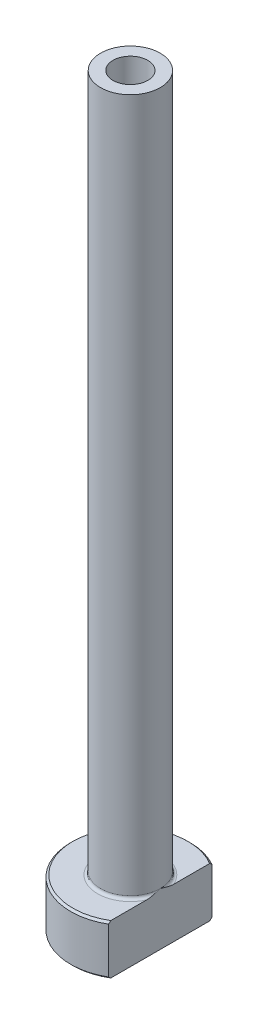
from build123d import *

# Parameters (mm, degrees)
FILLET1_R          = 0.3
CHAMFER1_SIZE      = 0.2
CUT_EXTRUDE1_DEPTH = 76.478473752
CHAMFER2_SIZE      = 0.5


with BuildPart() as part:
    # Sketch1 → Revolve1 (revolve)
    with BuildSketch(Plane.XY, mode=Mode.PRIVATE) as revolve1_sk:
        Polygon((-1.75, 75), (-3, 75), (-3, 5), (-6, 5), (-6, 0), (-2, 0), (-2, 18), (-1.75, 30), align=None)
    revolve(revolve1_sk.sketch.rotate(Axis((0, 92.187680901, 0), (0, -1, 0)), 270), axis=Axis((0, 92.187680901, 0), (0, -1, 0)))

    # Fillet1
    fillet1_edges = [part.edges().sort_by_distance(p)[0] for p in [
        (0, 5, -3),
    ]]
    fillet(fillet1_edges, radius=FILLET1_R)

    # Chamfer1
    chamfer1_edges = [part.edges().sort_by_distance(p)[0] for p in [
        (0, 0, -6),
        (0, 5, -6),
    ]]
    chamfer(chamfer1_edges, length=CHAMFER1_SIZE)

    # Sketch2 → Cut-Extrude1 (cut, through all)
    with BuildSketch(Plane.XZ):
        with BuildLine():
            Line((3, 5.196152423), (3, -5.196152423))
            ThreePointArc((3, -5.196152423), (6, 0), (3, 5.196152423))
        make_face()
    extrude(amount=-CUT_EXTRUDE1_DEPTH, mode=Mode.SUBTRACT)

    # Chamfer2
    chamfer2_edges = [part.edges().sort_by_distance(p)[0] for p in [
        (0, 0, -2),
    ]]
    chamfer(chamfer2_edges, length=CHAMFER2_SIZE)


solid = part.part
